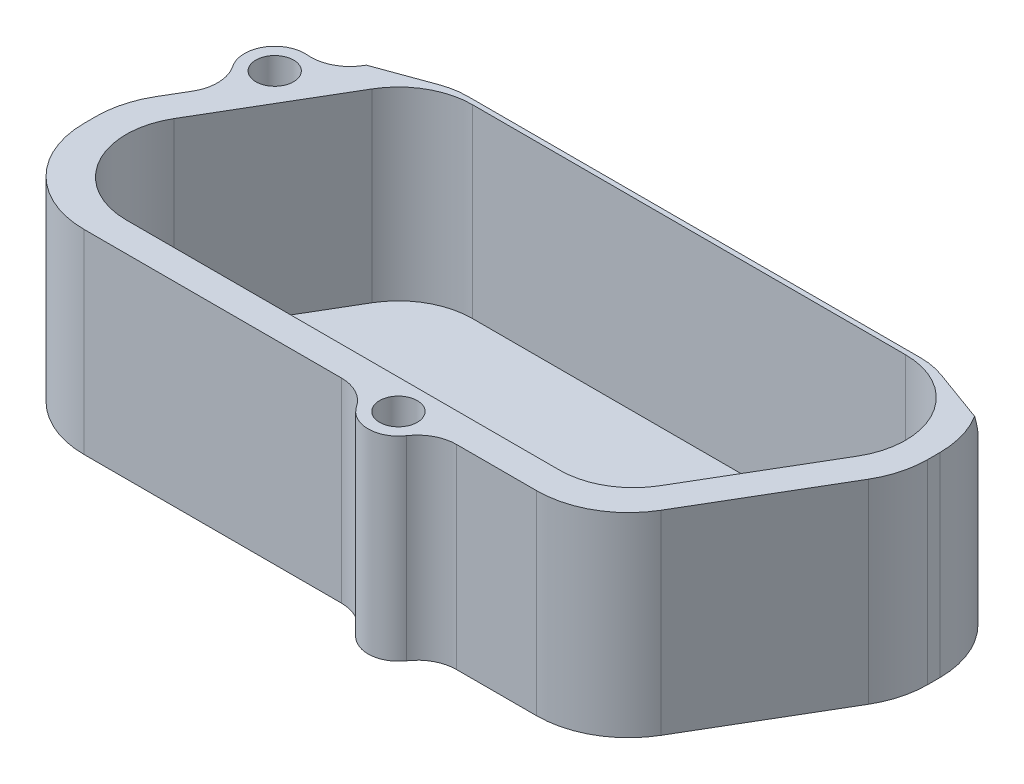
from build123d import *

# Parameters (mm, degrees)
BOSS_EXTRUDE1_DEPTH          = 25.4
F_10_0_1935_DIAMETER_HOLE1_D = 4.9149
FILLET3_R                    = 5.08
BOSS_EXTRUDE2_DEPTH          = 1.27


with BuildPart() as part:
    # Sketch1 → Boss-Extrude1 (new body)
    with BuildSketch(Plane(origin=(0, 0, 0), x_dir=(1, 0, 0), z_dir=(0, 1, 0))):
        with BuildLine():
            Line((-32.397057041, 29.09764083), (-30.198415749, 32.836951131))
            ThreePointArc((-30.198415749, 32.836951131), (-25.827346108, 37.156295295), (-19.888434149, 38.735))
            Line((-19.888434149, 38.735), (39.074273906, 38.735))
            ThreePointArc((39.074273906, 38.735), (47.53135326, 35.231963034), (51.034390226, 26.77488368))
            Line((51.034390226, 26.77488368), (51.034390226, 25.159181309))
            ThreePointArc((51.034390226, 25.159181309), (50.614485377, 22.017859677), (49.384255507, 19.097113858))
            Line((49.384255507, 19.097113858), (39.383258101, 2.088048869))
            ThreePointArc((39.383258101, 2.088048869), (35.01218846, -2.231295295), (29.0732765, -3.81))
            Line((29.0732765, -3.81), (15.070096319, -3.81))
            ThreePointArc((15.070096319, -3.81), (11.133669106, -7.814155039), (7.197241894, -3.81))
            Line((7.197241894, -3.81), (-29.889431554, -3.81))
            ThreePointArc((-29.889431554, -3.81), (-38.346510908, -0.306963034), (-41.849547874, 8.15011632))
            Line((-41.849547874, 8.15011632), (-41.849547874, 9.765818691))
            ThreePointArc((-41.849547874, 9.765818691), (-41.429643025, 12.907140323), (-40.199413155, 15.827886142))
            Line((-40.199413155, 15.827886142), (-36.191975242, 22.64348354))
            ThreePointArc((-36.191975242, 22.64348354), (-38.739009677, 28.483837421), (-32.397057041, 29.09764083))
        make_face()
        with BuildLine():
            Line((-28.214091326, 0), (28.214091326, 0))
            ThreePointArc((28.214091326, 0), (33.006885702, 1.274039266), (36.534406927, 4.759817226))
            Line((36.534406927, 4.759817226), (46.092616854, 21.015817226))
            ThreePointArc((46.092616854, 21.015817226), (47.096805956, 23.415066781), (47.423906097, 25.995338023))
            ThreePointArc((47.423906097, 25.995338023), (44.56634708, 32.763803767), (37.772301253, 35.56))
            Line((37.772301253, 35.56), (-18.655881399, 35.56))
            ThreePointArc((-18.655881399, 35.56), (-23.448675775, 34.285960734), (-26.976197, 30.800182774))
            Line((-26.976197, 30.800182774), (-36.534406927, 14.544182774))
            ThreePointArc((-36.534406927, 14.544182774), (-37.527221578, 12.187095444), (-37.866091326, 9.652))
            ThreePointArc((-37.866091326, 9.652), (-35.039085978, 2.827005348), (-28.214091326, 0))
        make_face(mode=Mode.SUBTRACT)
    extrude(amount=BOSS_EXTRUDE1_DEPTH)

    # 10 _0.1935_ Diameter Hole1 (through all)
    with Locations(Plane(origin=(0, 25.4, 0), x_dir=(1, 0, 0), z_dir=(0, 1, 0))):
        with Locations((-35.345196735, 26.488341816), (11.133669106, -3.877155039)):
            Hole(F_10_0_1935_DIAMETER_HOLE1_D / 2)

    # Fillet3
    fillet3_edges = [part.edges().sort_by_distance(p)[0] for p in [
        (15.070096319, 12.7, 3.81),
        (7.197241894, 12.7, 3.81),
        (-32.397057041, 12.7, -29.09764083),
        (-36.191975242, 12.7, -22.64348354),
    ]]
    fillet(fillet3_edges, radius=FILLET3_R)

    # Cut-Sweep2: sweep along a path in Sketch4
    with BuildLine(Plane(origin=(0, 25.4, 0), x_dir=(1, 0, 0), z_dir=(0, 1, 0))) as cut_sweep2_path:
        Line((-35.91313113, 33.670060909), (-23.979034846, 38.01371673))
        ThreePointArc((-23.979034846, 38.01371673), (-21.965286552, 38.553298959), (-19.888434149, 38.735))
        Line((-19.888434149, 38.735), (39.074273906, 38.735))
        ThreePointArc((39.074273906, 38.735), (41.15112631, 38.553298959), (43.164874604, 38.01371673))
        Line((43.164874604, 38.01371673), (55.098970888, 33.670060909))
    # Sketch5 → Cut-Sweep2 (sweep, cut)
    with BuildSketch(Plane(origin=(62.25515358, 25.4, -53.331511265), x_dir=(-0.34202014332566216, 0, 0.9396926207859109), z_dir=(-0.9396926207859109, 0, -0.34202014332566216))):
        Polygon((20.923278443, 0), (23.463278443, 0), (20.923278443, -6.978592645), align=None)
    sweep(path=cut_sweep2_path.line, mode=Mode.SUBTRACT)

    # Sketch6 → Boss-Extrude2 (add)
    with BuildSketch(Plane.XZ):
        with BuildLine():
            Line((-26.976197, -30.800182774), (-36.534406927, -14.544182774))
            ThreePointArc((-36.534406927, -14.544182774), (-36.59205206, -4.859205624), (-28.214091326, 0))
            Line((-28.214091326, 0), (28.214091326, 0))
            ThreePointArc((28.214091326, 0), (33.006885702, -1.274039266), (36.534406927, -4.759817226))
            Line((36.534406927, -4.759817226), (46.092616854, -21.015817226))
            ThreePointArc((46.092616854, -21.015817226), (46.150261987, -30.700794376), (37.772301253, -35.56))
            Line((37.772301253, -35.56), (-18.655881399, -35.56))
            ThreePointArc((-18.655881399, -35.56), (-23.448675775, -34.285960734), (-26.976197, -30.800182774))
        make_face()
    extrude(amount=-BOSS_EXTRUDE2_DEPTH)


solid = part.part
